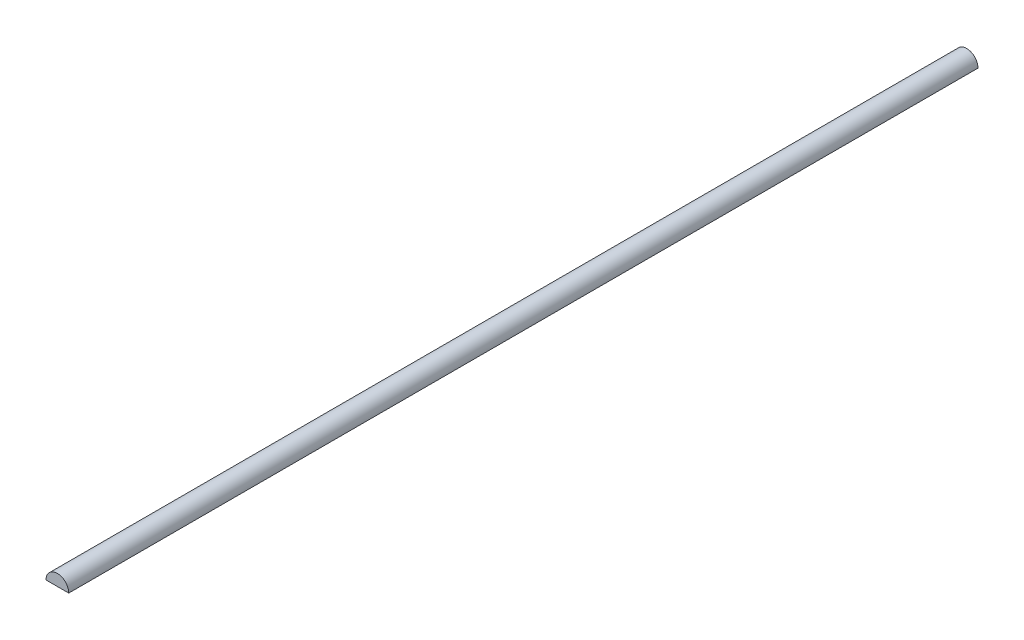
from build123d import *

# Parameters (mm, degrees)
BOSS_EXTRUDE1_DEPTH = 400


with BuildPart() as part:
    # Sketch1 → Boss-Extrude1 (new body)
    with BuildSketch(Plane.XY):
        with BuildLine():
            Line((-5, 0), (5, 0))
            ThreePointArc((5, 0), (0, 5), (-5, 0))
        make_face()
    extrude(amount=BOSS_EXTRUDE1_DEPTH)


solid = part.part
